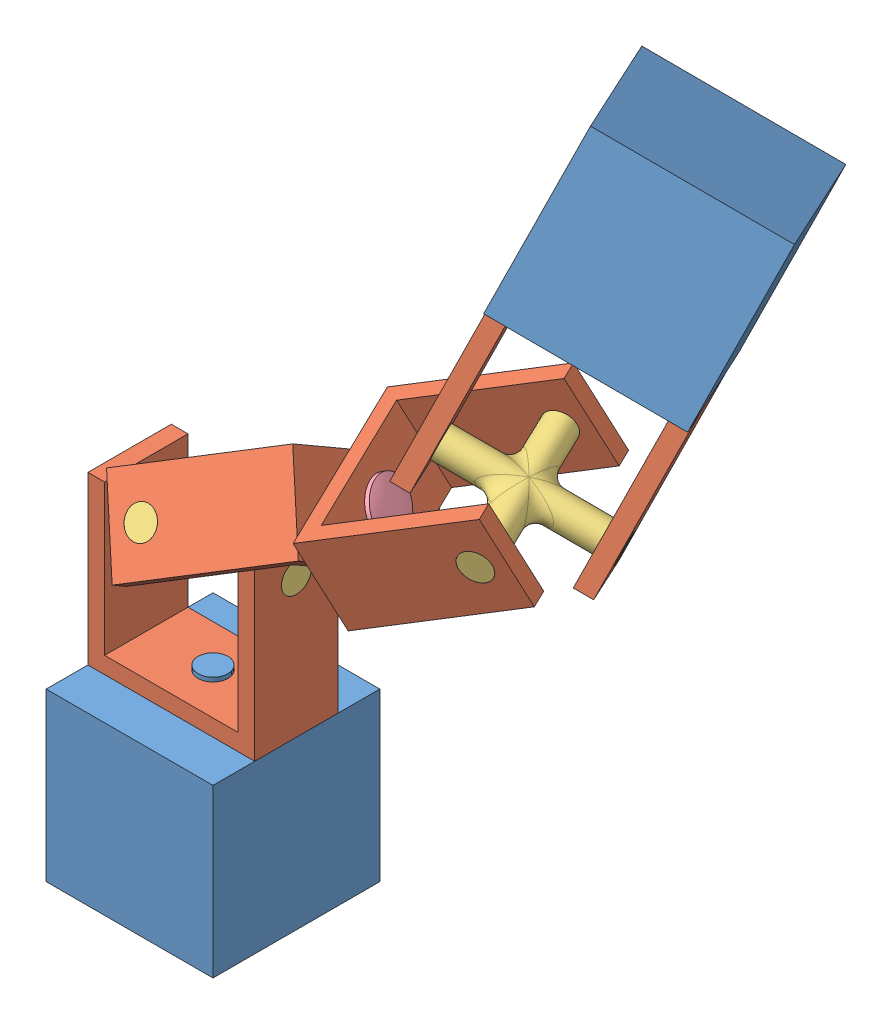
SolidWorks assembly CSWAAssem2.SLDASM, configuration Default (file format 5000). Lengths in mm.
Overall size (76.91 114.08 60).
9 component instances, 4 part files, 23 mates.
Components (placement in the parent):
- post-3: post.SLDPRT [Default] at origin size (25.4 28.57 25.4)
- CSWAAssembly2pivot-1: CSWAAssembly2pivot.SLDPRT [Default] at (0 12.7 0) x (0 0 1) z (-1 0 0) size (12.7 25.4 25.4)
- CSWAAssembly2swivel-1: CSWAAssembly2swivel.SLDPRT [Default] at (0 33.8141 0) x (0 0.5 0.866025) z (-1 0 0) size (25.4 4.57 25.4)
- CSWAAssembly2pivot-2: CSWAAssembly2pivot.SLDPRT [Default] at (18.2853 42.9567 -5.2785) x (-0.5 0.75 -0.433013) z (0 0.5 0.866025) size (12.7 25.4 25.4)
- CSWAAssembly2rivet-1: CSWAAssembly2rivet.SLDPRT [Default] at (21.5849 44.6065 -6.231) x (-0.180476 -0.195578 -0.963939) z (0.466292 -0.879914 0.091227) size (7.62 7.62 7.62)
- CSWAAssembly2pivot-3: CSWAAssembly2pivot.SLDPRT [Default] at (18.2853 42.9567 -5.2785) x (0.353553 -0.883883 -0.306186) z (0.353553 -0.176777 0.918559) size (12.7 25.4 25.4)
- CSWAAssembly2swivel-3: CSWAAssembly2swivel.SLDPRT [Default] at (36.5706 52.0994 -10.557) x (0.353553 -0.176777 0.918559) z (-0.827508 0.398759 0.395249) size (25.4 4.57 25.4)
- CSWAAssembly2pivot-4: CSWAAssembly2pivot.SLDPRT [Default] at (41.3869 70.7227 -19.2622) x (0.513028 0.251017 0.820849) z (0.827508 -0.398759 -0.395249) size (12.7 25.4 25.4)
- post-4: post.SLDPRT [Default] at (44.2838 81.9245 -24.4983) x (-0.827508 0.398759 0.395249) z (0.513028 0.251017 0.820849) size (25.4 28.57 25.4)
Mates (geometry in assembly coordinates):
- Concentric3: concentric aligned: cylinder of post-3 through (0 15.875 0) axis (0 -1 0) radius 2.286; cylinder of CSWAAssembly2pivot-1 through (0 38.1 0) axis (0 -1 0) radius 2.2892
- Coincident3: coincident anti-aligned: plane of post-3 through (-12.7 12.7 12.7) normal (0 1 0); plane of CSWAAssembly2pivot-1 through (-12.7 12.7 6.35) normal (0 -1 0)
- Parallel1: parallel aligned: plane of CSWAAssembly2pivot-1 through (-12.7 38.1 6.35) normal (-1 0 0); plane of post-3 through (-12.7 12.7 -12.7) normal (-1 0 0)
- Concentric4: concentric anti-aligned: cylinder of CSWAAssembly2pivot-1 through (12.7 33.8141 0) axis (-1 0 0) radius 2.2892; cylinder of CSWAAssembly2swivel-1 through (-12.7 33.8141 0) axis (1 0 0) radius 2.286
- Coincident5: coincident aligned: plane of CSWAAssembly2pivot-1 through (-12.7 38.1 6.35) normal (-1 0 0); plane of CSWAAssembly2swivel-1 through (-12.7 33.8141 0) normal (-1 0 0)
- Concentric5: concentric anti-aligned: cylinder of CSWAAssembly2swivel-1 through (0 40.1641 10.9985) axis (0 -0.5 -0.866025) radius 2.286; cylinder of CSWAAssembly2pivot-2 through (0 27.4641 -10.9985) axis (0 0.5 0.866025) radius 2.2892
- Coincident6: coincident aligned: plane of CSWAAssembly2swivel-1 through (0 40.1641 10.9985) normal (0 0.5 0.866025); plane of CSWAAssembly2pivot-2
- Concentric6: concentric anti-aligned: cylinder of CSWAAssembly2pivot-2 through (-3.7117 31.9582 1.0715) axis (0.866025 0.433013 -0.25) radius 2.2892; cylinder of CSWAAssembly2rivet-1 through (14.9858 41.307 -4.326) axis (-0.866025 -0.433013 0.25) radius 2.286
- Coincident7: coincident anti-aligned: plane of CSWAAssembly2pivot-2 through (12.9106 52.9694 3.6054) normal (-0.866025 -0.433013 0.25); plane of CSWAAssembly2rivet-1 through (15.0197 43.8684 -4.8521) normal (0.866025 0.433013 -0.25)
- Concentric7: concentric anti-aligned: cylinder of CSWAAssembly2pivot-2 through (-3.7117 31.9582 1.0715) axis (0.866025 0.433013 -0.25) radius 2.2892; cylinder of CSWAAssembly2pivot-3 through (40.2824 53.9553 -11.6285) axis (-0.866025 -0.433013 0.25) radius 2.2892
- Coincident8: coincident anti-aligned: plane of CSWAAssembly2pivot-2 through (15.1103 54.0692 2.9704) normal (0.866025 0.433013 -0.25); plane of CSWAAssembly2pivot-3
- Concentric8: concentric anti-aligned: cylinder of CSWAAssembly2pivot-3 through (32.0805 54.3445 -22.2227) axis (0.353553 -0.176777 0.918559) radius 2.2892; cylinder of CSWAAssembly2swivel-3 through (41.0608 49.8543 1.1087) axis (-0.353553 0.176777 -0.918559) radius 2.286
- Coincident9: coincident aligned: plane of CSWAAssembly2pivot-3; plane of CSWAAssembly2swivel-3
- Concentric9: concentric aligned: cylinder of CSWAAssembly2swivel-3 through (26.0613 57.1636 -5.5374) axis (0.827508 -0.398759 -0.395249) radius 2.286; cylinder of CSWAAssembly2pivot-4 through (26.0613 57.1636 -5.5374) axis (0.827508 -0.398759 -0.395249) radius 2.2892
- Coincident10: coincident aligned: plane of CSWAAssembly2swivel-3 through (47.08 47.0352 -15.5767) normal (0.827508 -0.398759 -0.395249); plane of CSWAAssembly2pivot-4
- Concentric10: concentric aligned: cylinder of CSWAAssembly2pivot-4 through (35.593 48.3191 -8.79) axis (0.228106 0.882033 -0.412293) radius 2.2892; cylinder of post-4 through (40.6627 67.9222 -17.9532) axis (0.228106 0.882033 -0.412293) radius 2.286
- Coincident11: coincident anti-aligned: plane of CSWAAssembly2pivot-4; plane of post-4
- Parallel2: parallel aligned: plane of CSWAAssembly2pivot-4; plane of post-4
- Angle1: planar angle = 1.047198 rad aligned: plane of CSWAAssembly2pivot-1 through (-12.7 38.1 6.35) normal (-1 0 0); plane of CSWAAssembly2pivot-2 through (-6.8867 41.8007 7.1207) normal (-0.5 0.75 -0.433013)
- Angle2: planar angle = 0.523599 rad aligned: plane of CSWAAssembly2pivot-2; plane of CSWAAssembly2pivot-1
- Angle3: planar angle = 0.785398 rad aligned: plane of CSWAAssembly2pivot-2; plane of CSWAAssembly2pivot-3
- Angle4: planar angle = 0.471239 rad aligned: plane of CSWAAssembly2pivot-3; plane of CSWAAssembly2pivot-4
- Angle6: planar angle = 0.698132 rad aligned: plane of CSWAAssembly2pivot-4 through (28.3414 54.9773 1.4421) normal (-0.827508 0.398759 0.395249); plane of CSWAAssembly2pivot-3 through (41.6294 57.7719 -0.3517) normal (-0.353553 0.883883 0.306186)
